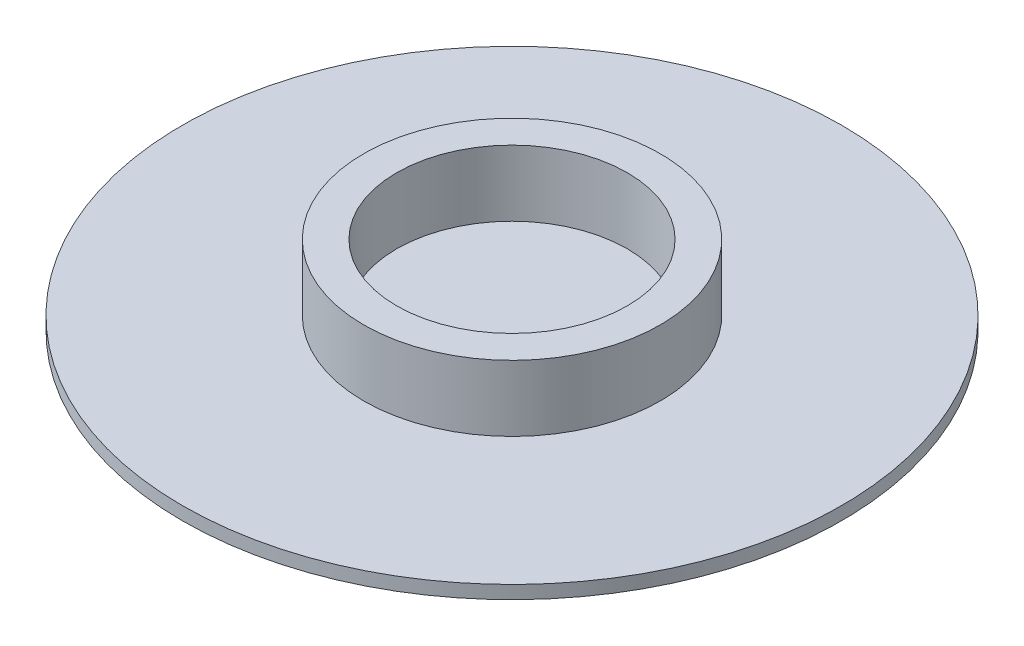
from build123d import *

# Parameters (mm, degrees)
SKETCH1_R           = 63.5
BOSS_EXTRUDE1_DEPTH = 2.54
SKETCH2_R           = 28.575
SKETCH2_R_2         = 22.225
BOSS_EXTRUDE2_DEPTH = 12.7


with BuildPart() as part:
    # Sketch1 → Boss-Extrude1 (new body)
    with BuildSketch(Plane(origin=(0, 0, 0), x_dir=(1, 0, 0), z_dir=(0, 1, 0))):
        with Locations(Location((0, 0, 0), (0, 0, 270))):
            Circle(SKETCH1_R)
    extrude(amount=BOSS_EXTRUDE1_DEPTH)

    # Sketch2 → Boss-Extrude2 (add)
    with BuildSketch(Plane(origin=(0, 2.54, 0), x_dir=(1, 0, 0), z_dir=(0, 1, 0))):
        with Locations(Location((0, 0, 0), (0, 0, 270))):
            Circle(SKETCH2_R)
        with Locations(Location((0, 0, 0), (0, 0, 270))):
            Circle(SKETCH2_R_2, mode=Mode.SUBTRACT)
    extrude(amount=BOSS_EXTRUDE2_DEPTH)


solid = part.part
